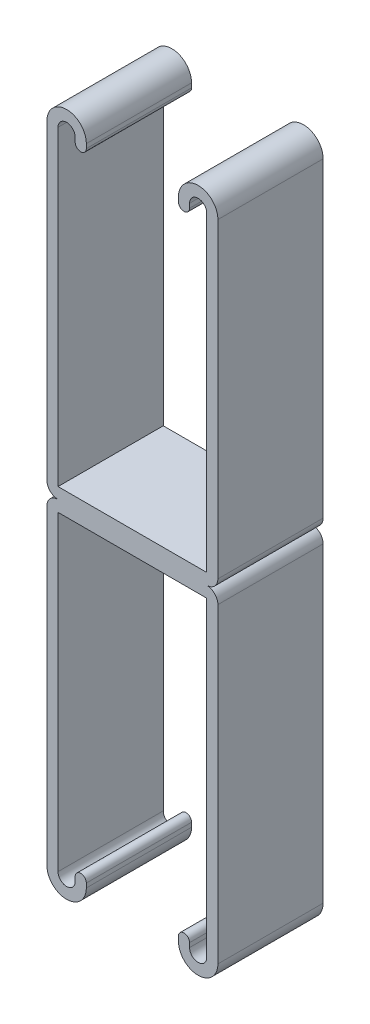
ISO-10303-21;
HEADER;
FILE_DESCRIPTION(('STEP AP214'),'2;1');
FILE_NAME('part.step','',(''),(''),'','','');
FILE_SCHEMA(('AUTOMOTIVE_DESIGN { 1 0 10303 214 1 1 1 1 }'));
ENDSEC;
DATA;
#1=APPLICATION_CONTEXT('core data for automotive mechanical design processes');
#2=APPLICATION_PROTOCOL_DEFINITION('international standard','automotive_design',2000,#1);
#3=PRODUCT_CONTEXT('',#1,'mechanical');
#4=PRODUCT('Part','Part','',(#3));
#5=PRODUCT_RELATED_PRODUCT_CATEGORY('part','',(#4));
#6=PRODUCT_DEFINITION_FORMATION('','',#4);
#7=PRODUCT_DEFINITION_CONTEXT('part definition',#1,'design');
#8=PRODUCT_DEFINITION('design','',#6,#7);
#9=PRODUCT_DEFINITION_SHAPE('','',#8);
#10=(LENGTH_UNIT() NAMED_UNIT(*) SI_UNIT(.MILLI.,.METRE.));
#11=(NAMED_UNIT(*) PLANE_ANGLE_UNIT() SI_UNIT($,.RADIAN.));
#12=(NAMED_UNIT(*) SI_UNIT($,.STERADIAN.) SOLID_ANGLE_UNIT());
#13=UNCERTAINTY_MEASURE_WITH_UNIT(LENGTH_MEASURE(1.E-05),#10,'distance_accuracy_value','');
#14=(GEOMETRIC_REPRESENTATION_CONTEXT(3) GLOBAL_UNCERTAINTY_ASSIGNED_CONTEXT((#13)) GLOBAL_UNIT_ASSIGNED_CONTEXT((#10,
#11,#12)) REPRESENTATION_CONTEXT('',''));
#15=CARTESIAN_POINT('',(0.,0.,0.));
#16=DIRECTION('',(0.,0.,1.));
#17=DIRECTION('',(1.,0.,0.));
#18=AXIS2_PLACEMENT_3D('',#15,#16,#17);
#19=CARTESIAN_POINT('',(-15.875,77.7875,12.7));
#20=DIRECTION('',(0.,0.,-1.));
#21=DIRECTION('',(-1.,0.,0.));
#22=AXIS2_PLACEMENT_3D('',#19,#20,#21);
#23=CYLINDRICAL_SURFACE('',#22,4.76250000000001);
#24=CARTESIAN_POINT('',(-15.875,77.7875,-12.7));
#25=DIRECTION('',(0.,0.,1.));
#26=DIRECTION('',(-1.,0.,0.));
#27=AXIS2_PLACEMENT_3D('',#24,#25,#26);
#28=CIRCLE('',#27,4.76250000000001);
#29=CARTESIAN_POINT('',(-11.1125,77.7875,-12.7));
#30=VERTEX_POINT('',#29);
#31=CARTESIAN_POINT('',(-20.6375,77.7875,-12.7));
#32=VERTEX_POINT('',#31);
#33=EDGE_CURVE('E190',#30,#32,#28,.T.);
#34=ORIENTED_EDGE('',*,*,#33,.T.);
#35=DIRECTION('',(0.,0.,-1.));
#36=VECTOR('',#35,1.);
#37=CARTESIAN_POINT('',(-20.6375,77.7875,12.7));
#38=LINE('',#37,#36);
#39=CARTESIAN_POINT('',(-20.6375,77.7875,12.7));
#40=VERTEX_POINT('',#39);
#41=EDGE_CURVE('E11',#40,#32,#38,.T.);
#42=ORIENTED_EDGE('',*,*,#41,.F.);
#43=CARTESIAN_POINT('',(-15.875,77.7875,12.7));
#44=DIRECTION('',(0.,0.,1.));
#45=DIRECTION('',(-1.,0.,0.));
#46=AXIS2_PLACEMENT_3D('',#43,#44,#45);
#47=CIRCLE('',#46,4.76250000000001);
#48=CARTESIAN_POINT('',(-11.1125,77.7875,12.7));
#49=VERTEX_POINT('',#48);
#50=EDGE_CURVE('E223',#49,#40,#47,.T.);
#51=ORIENTED_EDGE('',*,*,#50,.F.);
#52=DIRECTION('',(0.,0.,-1.));
#53=VECTOR('',#52,1.);
#54=CARTESIAN_POINT('',(-11.1125,77.7875,12.7));
#55=LINE('',#54,#53);
#56=EDGE_CURVE('E186',#49,#30,#55,.T.);
#57=ORIENTED_EDGE('',*,*,#56,.T.);
#58=EDGE_LOOP('',(#34,#42,#51,#57));
#59=FACE_BOUND('',#58,.T.);
#60=ADVANCED_FACE('F33',(#59),#23,.T.);
#61=CARTESIAN_POINT('',(-20.6375,77.7875,12.7));
#62=DIRECTION('',(1.,0.,0.));
#63=DIRECTION('',(0.,1.,0.));
#64=AXIS2_PLACEMENT_3D('',#61,#62,#63);
#65=PLANE('',#64);
#66=DIRECTION('',(0.,-1.,0.));
#67=VECTOR('',#66,1.);
#68=CARTESIAN_POINT('',(-20.6375,77.7875,-12.7));
#69=LINE('',#68,#67);
#70=CARTESIAN_POINT('',(-20.6375,2.6924,-12.7));
#71=VERTEX_POINT('',#70);
#72=EDGE_CURVE('E193',#32,#71,#69,.T.);
#73=ORIENTED_EDGE('',*,*,#72,.T.);
#74=DIRECTION('',(0.,0.,-1.));
#75=VECTOR('',#74,1.);
#76=CARTESIAN_POINT('',(-20.6375,2.6924,12.7));
#77=LINE('',#76,#75);
#78=CARTESIAN_POINT('',(-20.6375,2.6924,12.7));
#79=VERTEX_POINT('',#78);
#80=EDGE_CURVE('E41',#79,#71,#77,.T.);
#81=ORIENTED_EDGE('',*,*,#80,.F.);
#82=DIRECTION('',(0.,-1.,0.));
#83=VECTOR('',#82,1.);
#84=CARTESIAN_POINT('',(-20.6375,77.7875,12.7));
#85=LINE('',#84,#83);
#86=EDGE_CURVE('E120',#40,#79,#85,.T.);
#87=ORIENTED_EDGE('',*,*,#86,.F.);
#88=ORIENTED_EDGE('',*,*,#41,.T.);
#89=EDGE_LOOP('',(#73,#81,#87,#88));
#90=FACE_BOUND('',#89,.T.);
#91=ADVANCED_FACE('F385',(#90),#65,.F.);
#92=CARTESIAN_POINT('',(-17.9451,2.6924,12.7));
#93=DIRECTION('',(0.,0.,-1.));
#94=DIRECTION('',(-1.,0.,0.));
#95=AXIS2_PLACEMENT_3D('',#92,#93,#94);
#96=CYLINDRICAL_SURFACE('',#95,2.6924);
#97=CARTESIAN_POINT('',(-17.9451,2.6924,-12.7));
#98=DIRECTION('',(0.,0.,1.));
#99=DIRECTION('',(-1.,0.,0.));
#100=AXIS2_PLACEMENT_3D('',#97,#98,#99);
#101=CIRCLE('',#100,2.6924);
#102=CARTESIAN_POINT('',(-17.9451,0.,-12.7));
#103=VERTEX_POINT('',#102);
#104=EDGE_CURVE('E196',#71,#103,#101,.T.);
#105=ORIENTED_EDGE('',*,*,#104,.T.);
#106=DIRECTION('',(0.,0.,-1.));
#107=VECTOR('',#106,1.);
#108=CARTESIAN_POINT('',(-17.9451,0.,12.7));
#109=LINE('',#108,#107);
#110=CARTESIAN_POINT('',(-17.9451,0.,12.7));
#111=VERTEX_POINT('',#110);
#112=EDGE_CURVE('E260',#111,#103,#109,.T.);
#113=ORIENTED_EDGE('',*,*,#112,.F.);
#114=CARTESIAN_POINT('',(-17.9451,2.6924,12.7));
#115=DIRECTION('',(0.,0.,1.));
#116=DIRECTION('',(-1.,0.,0.));
#117=AXIS2_PLACEMENT_3D('',#114,#115,#116);
#118=CIRCLE('',#117,2.6924);
#119=EDGE_CURVE('E268',#79,#111,#118,.T.);
#120=ORIENTED_EDGE('',*,*,#119,.F.);
#121=ORIENTED_EDGE('',*,*,#80,.T.);
#122=EDGE_LOOP('',(#105,#113,#120,#121));
#123=FACE_BOUND('',#122,.T.);
#124=ADVANCED_FACE('F266',(#123),#96,.T.);
#125=CARTESIAN_POINT('',(17.9451,2.69240000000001,12.7));
#126=DIRECTION('',(0.,0.,-1.));
#127=DIRECTION('',(-1.,0.,0.));
#128=AXIS2_PLACEMENT_3D('',#125,#126,#127);
#129=CYLINDRICAL_SURFACE('',#128,2.6924);
#130=CARTESIAN_POINT('',(17.9451,2.69240000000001,-12.7));
#131=DIRECTION('',(0.,0.,1.));
#132=DIRECTION('',(1.,0.,0.));
#133=AXIS2_PLACEMENT_3D('',#130,#131,#132);
#134=CIRCLE('',#133,2.6924);
#135=CARTESIAN_POINT('',(17.9451,0.,-12.7));
#136=VERTEX_POINT('',#135);
#137=CARTESIAN_POINT('',(20.6375,2.69240000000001,-12.7));
#138=VERTEX_POINT('',#137);
#139=EDGE_CURVE('E198',#136,#138,#134,.T.);
#140=ORIENTED_EDGE('',*,*,#139,.T.);
#141=DIRECTION('',(0.,0.,-1.));
#142=VECTOR('',#141,1.);
#143=CARTESIAN_POINT('',(20.6375,2.69240000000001,12.7));
#144=LINE('',#143,#142);
#145=CARTESIAN_POINT('',(20.6375,2.69240000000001,12.7));
#146=VERTEX_POINT('',#145);
#147=EDGE_CURVE('E254',#146,#138,#144,.T.);
#148=ORIENTED_EDGE('',*,*,#147,.F.);
#149=CARTESIAN_POINT('',(17.9451,2.69240000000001,12.7));
#150=DIRECTION('',(0.,0.,1.));
#151=DIRECTION('',(1.,0.,0.));
#152=AXIS2_PLACEMENT_3D('',#149,#150,#151);
#153=CIRCLE('',#152,2.6924);
#154=CARTESIAN_POINT('',(17.9451,0.,12.7));
#155=VERTEX_POINT('',#154);
#156=EDGE_CURVE('E342',#155,#146,#153,.T.);
#157=ORIENTED_EDGE('',*,*,#156,.F.);
#158=DIRECTION('',(0.,0.,-1.));
#159=VECTOR('',#158,1.);
#160=CARTESIAN_POINT('',(17.9451,0.,12.7));
#161=LINE('',#160,#159);
#162=EDGE_CURVE('E257',#155,#136,#161,.T.);
#163=ORIENTED_EDGE('',*,*,#162,.T.);
#164=EDGE_LOOP('',(#140,#148,#157,#163));
#165=FACE_BOUND('',#164,.T.);
#166=ADVANCED_FACE('F392',(#165),#129,.T.);
#167=CARTESIAN_POINT('',(20.6375,2.69240000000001,12.7));
#168=DIRECTION('',(-1.,0.,0.));
#169=DIRECTION('',(0.,-1.,0.));
#170=AXIS2_PLACEMENT_3D('',#167,#168,#169);
#171=PLANE('',#170);
#172=DIRECTION('',(0.,1.,0.));
#173=VECTOR('',#172,1.);
#174=CARTESIAN_POINT('',(20.6375,2.69240000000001,-12.7));
#175=LINE('',#174,#173);
#176=CARTESIAN_POINT('',(20.6375,77.7875,-12.7));
#177=VERTEX_POINT('',#176);
#178=EDGE_CURVE('E200',#138,#177,#175,.T.);
#179=ORIENTED_EDGE('',*,*,#178,.T.);
#180=DIRECTION('',(0.,0.,-1.));
#181=VECTOR('',#180,1.);
#182=CARTESIAN_POINT('',(20.6375,77.7875,12.7));
#183=LINE('',#182,#181);
#184=CARTESIAN_POINT('',(20.6375,77.7875,12.7));
#185=VERTEX_POINT('',#184);
#186=EDGE_CURVE('E251',#185,#177,#183,.T.);
#187=ORIENTED_EDGE('',*,*,#186,.F.);
#188=DIRECTION('',(0.,1.,0.));
#189=VECTOR('',#188,1.);
#190=CARTESIAN_POINT('',(20.6375,2.69240000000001,12.7));
#191=LINE('',#190,#189);
#192=EDGE_CURVE('E344',#146,#185,#191,.T.);
#193=ORIENTED_EDGE('',*,*,#192,.F.);
#194=ORIENTED_EDGE('',*,*,#147,.T.);
#195=EDGE_LOOP('',(#179,#187,#193,#194));
#196=FACE_BOUND('',#195,.T.);
#197=ADVANCED_FACE('F397',(#196),#171,.F.);
#198=CARTESIAN_POINT('',(15.875,77.7875,12.7));
#199=DIRECTION('',(0.,0.,-1.));
#200=DIRECTION('',(-1.,0.,0.));
#201=AXIS2_PLACEMENT_3D('',#198,#199,#200);
#202=CYLINDRICAL_SURFACE('',#201,4.76250000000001);
#203=CARTESIAN_POINT('',(15.875,77.7875,-12.7));
#204=DIRECTION('',(0.,0.,1.));
#205=DIRECTION('',(1.,0.,0.));
#206=AXIS2_PLACEMENT_3D('',#203,#204,#205);
#207=CIRCLE('',#206,4.76250000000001);
#208=CARTESIAN_POINT('',(11.1125,77.7875,-12.7));
#209=VERTEX_POINT('',#208);
#210=EDGE_CURVE('E202',#177,#209,#207,.T.);
#211=ORIENTED_EDGE('',*,*,#210,.T.);
#212=DIRECTION('',(0.,0.,-1.));
#213=VECTOR('',#212,1.);
#214=CARTESIAN_POINT('',(11.1125,77.7875,12.7));
#215=LINE('',#214,#213);
#216=CARTESIAN_POINT('',(11.1125,77.7875,12.7));
#217=VERTEX_POINT('',#216);
#218=EDGE_CURVE('E248',#217,#209,#215,.T.);
#219=ORIENTED_EDGE('',*,*,#218,.F.);
#220=CARTESIAN_POINT('',(15.875,77.7875,12.7));
#221=DIRECTION('',(0.,0.,1.));
#222=DIRECTION('',(1.,0.,0.));
#223=AXIS2_PLACEMENT_3D('',#220,#221,#222);
#224=CIRCLE('',#223,4.76250000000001);
#225=EDGE_CURVE('E346',#185,#217,#224,.T.);
#226=ORIENTED_EDGE('',*,*,#225,.F.);
#227=ORIENTED_EDGE('',*,*,#186,.T.);
#228=EDGE_LOOP('',(#211,#219,#226,#227));
#229=FACE_BOUND('',#228,.T.);
#230=ADVANCED_FACE('F401',(#229),#202,.T.);
#231=CARTESIAN_POINT('',(11.1125,77.7875,12.7));
#232=DIRECTION('',(1.,0.,0.));
#233=DIRECTION('',(0.,1.,0.));
#234=AXIS2_PLACEMENT_3D('',#231,#232,#233);
#235=PLANE('',#234);
#236=DIRECTION('',(0.,-1.,0.));
#237=VECTOR('',#236,1.);
#238=CARTESIAN_POINT('',(11.1125,77.7875,-12.7));
#239=LINE('',#238,#237);
#240=CARTESIAN_POINT('',(11.1125,76.75245,-12.7));
#241=VERTEX_POINT('',#240);
#242=EDGE_CURVE('E204',#209,#241,#239,.T.);
#243=ORIENTED_EDGE('',*,*,#242,.T.);
#244=DIRECTION('',(0.,0.,-1.));
#245=VECTOR('',#244,1.);
#246=CARTESIAN_POINT('',(11.1125,76.75245,12.7));
#247=LINE('',#246,#245);
#248=CARTESIAN_POINT('',(11.1125,76.75245,12.7));
#249=VERTEX_POINT('',#248);
#250=EDGE_CURVE('E245',#249,#241,#247,.T.);
#251=ORIENTED_EDGE('',*,*,#250,.F.);
#252=DIRECTION('',(0.,-1.,0.));
#253=VECTOR('',#252,1.);
#254=CARTESIAN_POINT('',(11.1125,77.7875,12.7));
#255=LINE('',#254,#253);
#256=EDGE_CURVE('E348',#217,#249,#255,.T.);
#257=ORIENTED_EDGE('',*,*,#256,.F.);
#258=ORIENTED_EDGE('',*,*,#218,.T.);
#259=EDGE_LOOP('',(#243,#251,#257,#258));
#260=FACE_BOUND('',#259,.T.);
#261=ADVANCED_FACE('F405',(#260),#235,.F.);
#262=CARTESIAN_POINT('',(12.4587,76.75245,12.7));
#263=DIRECTION('',(0.,0.,-1.));
#264=DIRECTION('',(-1.,0.,0.));
#265=AXIS2_PLACEMENT_3D('',#262,#263,#264);
#266=CYLINDRICAL_SURFACE('',#265,1.3462);
#267=CARTESIAN_POINT('',(12.4587,76.75245,-12.7));
#268=DIRECTION('',(0.,0.,1.));
#269=DIRECTION('',(1.,0.,0.));
#270=AXIS2_PLACEMENT_3D('',#267,#268,#269);
#271=CIRCLE('',#270,1.3462);
#272=CARTESIAN_POINT('',(13.8049,76.75245,-12.7));
#273=VERTEX_POINT('',#272);
#274=EDGE_CURVE('E206',#241,#273,#271,.T.);
#275=ORIENTED_EDGE('',*,*,#274,.T.);
#276=DIRECTION('',(0.,0.,-1.));
#277=VECTOR('',#276,1.);
#278=CARTESIAN_POINT('',(13.8049,76.75245,12.7));
#279=LINE('',#278,#277);
#280=CARTESIAN_POINT('',(13.8049,76.75245,12.7));
#281=VERTEX_POINT('',#280);
#282=EDGE_CURVE('E242',#281,#273,#279,.T.);
#283=ORIENTED_EDGE('',*,*,#282,.F.);
#284=CARTESIAN_POINT('',(12.4587,76.75245,12.7));
#285=DIRECTION('',(0.,0.,1.));
#286=DIRECTION('',(1.,0.,0.));
#287=AXIS2_PLACEMENT_3D('',#284,#285,#286);
#288=CIRCLE('',#287,1.3462);
#289=EDGE_CURVE('E350',#249,#281,#288,.T.);
#290=ORIENTED_EDGE('',*,*,#289,.F.);
#291=ORIENTED_EDGE('',*,*,#250,.T.);
#292=EDGE_LOOP('',(#275,#283,#290,#291));
#293=FACE_BOUND('',#292,.T.);
#294=ADVANCED_FACE('F409',(#293),#266,.T.);
#295=CARTESIAN_POINT('',(13.8049,77.7875,12.7));
#296=DIRECTION('',(-1.,0.,0.));
#297=DIRECTION('',(0.,-1.,0.));
#298=AXIS2_PLACEMENT_3D('',#295,#296,#297);
#299=PLANE('',#298);
#300=DIRECTION('',(0.,1.,0.));
#301=VECTOR('',#300,1.);
#302=CARTESIAN_POINT('',(13.8049,77.7875,-12.7));
#303=LINE('',#302,#301);
#304=CARTESIAN_POINT('',(13.8049,77.7875,-12.7));
#305=VERTEX_POINT('',#304);
#306=EDGE_CURVE('E208',#273,#305,#303,.T.);
#307=ORIENTED_EDGE('',*,*,#306,.T.);
#308=DIRECTION('',(0.,0.,-1.));
#309=VECTOR('',#308,1.);
#310=CARTESIAN_POINT('',(13.8049,77.7875,12.7));
#311=LINE('',#310,#309);
#312=CARTESIAN_POINT('',(13.8049,77.7875,12.7));
#313=VERTEX_POINT('',#312);
#314=EDGE_CURVE('E239',#313,#305,#311,.T.);
#315=ORIENTED_EDGE('',*,*,#314,.F.);
#316=DIRECTION('',(0.,1.,0.));
#317=VECTOR('',#316,1.);
#318=CARTESIAN_POINT('',(13.8049,77.7875,12.7));
#319=LINE('',#318,#317);
#320=EDGE_CURVE('E352',#281,#313,#319,.T.);
#321=ORIENTED_EDGE('',*,*,#320,.F.);
#322=ORIENTED_EDGE('',*,*,#282,.T.);
#323=EDGE_LOOP('',(#307,#315,#321,#322));
#324=FACE_BOUND('',#323,.T.);
#325=ADVANCED_FACE('F413',(#324),#299,.F.);
#326=CARTESIAN_POINT('',(15.875,77.7875,12.7));
#327=DIRECTION('',(0.,0.,-1.));
#328=DIRECTION('',(-1.,0.,0.));
#329=AXIS2_PLACEMENT_3D('',#326,#327,#328);
#330=CYLINDRICAL_SURFACE('',#329,2.07010000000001);
#331=CARTESIAN_POINT('',(15.875,77.7875,-12.7));
#332=DIRECTION('',(0.,0.,-1.));
#333=DIRECTION('',(1.,0.,0.));
#334=AXIS2_PLACEMENT_3D('',#331,#332,#333);
#335=CIRCLE('',#334,2.07010000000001);
#336=CARTESIAN_POINT('',(17.9451,77.7875,-12.7));
#337=VERTEX_POINT('',#336);
#338=EDGE_CURVE('E210',#305,#337,#335,.T.);
#339=ORIENTED_EDGE('',*,*,#338,.T.);
#340=DIRECTION('',(0.,0.,-1.));
#341=VECTOR('',#340,1.);
#342=CARTESIAN_POINT('',(17.9451,77.7875,12.7));
#343=LINE('',#342,#341);
#344=CARTESIAN_POINT('',(17.9451,77.7875,12.7));
#345=VERTEX_POINT('',#344);
#346=EDGE_CURVE('E236',#345,#337,#343,.T.);
#347=ORIENTED_EDGE('',*,*,#346,.F.);
#348=CARTESIAN_POINT('',(15.875,77.7875,12.7));
#349=DIRECTION('',(0.,0.,-1.));
#350=DIRECTION('',(1.,0.,0.));
#351=AXIS2_PLACEMENT_3D('',#348,#349,#350);
#352=CIRCLE('',#351,2.07010000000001);
#353=EDGE_CURVE('E354',#313,#345,#352,.T.);
#354=ORIENTED_EDGE('',*,*,#353,.F.);
#355=ORIENTED_EDGE('',*,*,#314,.T.);
#356=EDGE_LOOP('',(#339,#347,#354,#355));
#357=FACE_BOUND('',#356,.T.);
#358=ADVANCED_FACE('F417',(#357),#330,.F.);
#359=CARTESIAN_POINT('',(17.9451,2.6924,12.7));
#360=DIRECTION('',(1.,0.,0.));
#361=DIRECTION('',(0.,1.,0.));
#362=AXIS2_PLACEMENT_3D('',#359,#360,#361);
#363=PLANE('',#362);
#364=DIRECTION('',(0.,-1.,0.));
#365=VECTOR('',#364,1.);
#366=CARTESIAN_POINT('',(17.9451,2.6924,-12.7));
#367=LINE('',#366,#365);
#368=CARTESIAN_POINT('',(17.9451,2.6924,-12.7));
#369=VERTEX_POINT('',#368);
#370=EDGE_CURVE('E212',#337,#369,#367,.T.);
#371=ORIENTED_EDGE('',*,*,#370,.T.);
#372=DIRECTION('',(0.,0.,-1.));
#373=VECTOR('',#372,1.);
#374=CARTESIAN_POINT('',(17.9451,2.6924,12.7));
#375=LINE('',#374,#373);
#376=CARTESIAN_POINT('',(17.9451,2.6924,12.7));
#377=VERTEX_POINT('',#376);
#378=EDGE_CURVE('E233',#377,#369,#375,.T.);
#379=ORIENTED_EDGE('',*,*,#378,.F.);
#380=DIRECTION('',(0.,-1.,0.));
#381=VECTOR('',#380,1.);
#382=CARTESIAN_POINT('',(17.9451,2.6924,12.7));
#383=LINE('',#382,#381);
#384=EDGE_CURVE('E356',#345,#377,#383,.T.);
#385=ORIENTED_EDGE('',*,*,#384,.F.);
#386=ORIENTED_EDGE('',*,*,#346,.T.);
#387=EDGE_LOOP('',(#371,#379,#385,#386));
#388=FACE_BOUND('',#387,.T.);
#389=ADVANCED_FACE('F421',(#388),#363,.F.);
#390=CARTESIAN_POINT('',(-17.9451,2.6924,12.7));
#391=DIRECTION('',(0.,-1.,0.));
#392=DIRECTION('',(0.,0.,-1.));
#393=AXIS2_PLACEMENT_3D('',#390,#391,#392);
#394=PLANE('',#393);
#395=DIRECTION('',(-1.,0.,0.));
#396=VECTOR('',#395,1.);
#397=CARTESIAN_POINT('',(-17.9451,2.6924,-12.7));
#398=LINE('',#397,#396);
#399=CARTESIAN_POINT('',(-17.9451,2.6924,-12.7));
#400=VERTEX_POINT('',#399);
#401=EDGE_CURVE('E214',#369,#400,#398,.T.);
#402=ORIENTED_EDGE('',*,*,#401,.T.);
#403=DIRECTION('',(0.,0.,-1.));
#404=VECTOR('',#403,1.);
#405=CARTESIAN_POINT('',(-17.9451,2.6924,12.7));
#406=LINE('',#405,#404);
#407=CARTESIAN_POINT('',(-17.9451,2.6924,12.7));
#408=VERTEX_POINT('',#407);
#409=EDGE_CURVE('E230',#408,#400,#406,.T.);
#410=ORIENTED_EDGE('',*,*,#409,.F.);
#411=DIRECTION('',(-1.,0.,0.));
#412=VECTOR('',#411,1.);
#413=CARTESIAN_POINT('',(-17.9451,2.6924,12.7));
#414=LINE('',#413,#412);
#415=EDGE_CURVE('E358',#377,#408,#414,.T.);
#416=ORIENTED_EDGE('',*,*,#415,.F.);
#417=ORIENTED_EDGE('',*,*,#378,.T.);
#418=EDGE_LOOP('',(#402,#410,#416,#417));
#419=FACE_BOUND('',#418,.T.);
#420=ADVANCED_FACE('F425',(#419),#394,.F.);
#421=CARTESIAN_POINT('',(-17.9451,77.7875,12.7));
#422=DIRECTION('',(-1.,0.,0.));
#423=DIRECTION('',(0.,-1.,0.));
#424=AXIS2_PLACEMENT_3D('',#421,#422,#423);
#425=PLANE('',#424);
#426=DIRECTION('',(0.,1.,0.));
#427=VECTOR('',#426,1.);
#428=CARTESIAN_POINT('',(-17.9451,77.7875,-12.7));
#429=LINE('',#428,#427);
#430=CARTESIAN_POINT('',(-17.9451,77.7875,-12.7));
#431=VERTEX_POINT('',#430);
#432=EDGE_CURVE('E216',#400,#431,#429,.T.);
#433=ORIENTED_EDGE('',*,*,#432,.T.);
#434=DIRECTION('',(0.,0.,-1.));
#435=VECTOR('',#434,1.);
#436=CARTESIAN_POINT('',(-17.9451,77.7875,12.7));
#437=LINE('',#436,#435);
#438=CARTESIAN_POINT('',(-17.9451,77.7875,12.7));
#439=VERTEX_POINT('',#438);
#440=EDGE_CURVE('E227',#439,#431,#437,.T.);
#441=ORIENTED_EDGE('',*,*,#440,.F.);
#442=DIRECTION('',(0.,1.,0.));
#443=VECTOR('',#442,1.);
#444=CARTESIAN_POINT('',(-17.9451,77.7875,12.7));
#445=LINE('',#444,#443);
#446=EDGE_CURVE('E360',#408,#439,#445,.T.);
#447=ORIENTED_EDGE('',*,*,#446,.F.);
#448=ORIENTED_EDGE('',*,*,#409,.T.);
#449=EDGE_LOOP('',(#433,#441,#447,#448));
#450=FACE_BOUND('',#449,.T.);
#451=ADVANCED_FACE('F366',(#450),#425,.F.);
#452=CARTESIAN_POINT('',(-15.875,77.7875,12.7));
#453=DIRECTION('',(0.,0.,-1.));
#454=DIRECTION('',(-1.,0.,0.));
#455=AXIS2_PLACEMENT_3D('',#452,#453,#454);
#456=CYLINDRICAL_SURFACE('',#455,2.07010000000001);
#457=CARTESIAN_POINT('',(-15.875,77.7875,-12.7));
#458=DIRECTION('',(0.,0.,-1.));
#459=DIRECTION('',(-1.,0.,0.));
#460=AXIS2_PLACEMENT_3D('',#457,#458,#459);
#461=CIRCLE('',#460,2.07010000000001);
#462=CARTESIAN_POINT('',(-13.8049,77.7875,-12.7));
#463=VERTEX_POINT('',#462);
#464=EDGE_CURVE('E218',#431,#463,#461,.T.);
#465=ORIENTED_EDGE('',*,*,#464,.T.);
#466=DIRECTION('',(0.,0.,-1.));
#467=VECTOR('',#466,1.);
#468=CARTESIAN_POINT('',(-13.8049,77.7875,12.7));
#469=LINE('',#468,#467);
#470=CARTESIAN_POINT('',(-13.8049,77.7875,12.7));
#471=VERTEX_POINT('',#470);
#472=EDGE_CURVE('E181',#471,#463,#469,.T.);
#473=ORIENTED_EDGE('',*,*,#472,.F.);
#474=CARTESIAN_POINT('',(-15.875,77.7875,12.7));
#475=DIRECTION('',(0.,0.,-1.));
#476=DIRECTION('',(-1.,0.,0.));
#477=AXIS2_PLACEMENT_3D('',#474,#475,#476);
#478=CIRCLE('',#477,2.07010000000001);
#479=EDGE_CURVE('E172',#439,#471,#478,.T.);
#480=ORIENTED_EDGE('',*,*,#479,.F.);
#481=ORIENTED_EDGE('',*,*,#440,.T.);
#482=EDGE_LOOP('',(#465,#473,#480,#481));
#483=FACE_BOUND('',#482,.T.);
#484=ADVANCED_FACE('F370',(#483),#456,.F.);
#485=CARTESIAN_POINT('',(-13.8049,77.7875,12.7));
#486=DIRECTION('',(1.,0.,0.));
#487=DIRECTION('',(0.,1.,0.));
#488=AXIS2_PLACEMENT_3D('',#485,#486,#487);
#489=PLANE('',#488);
#490=DIRECTION('',(0.,-1.,0.));
#491=VECTOR('',#490,1.);
#492=CARTESIAN_POINT('',(-13.8049,77.7875,-12.7));
#493=LINE('',#492,#491);
#494=CARTESIAN_POINT('',(-13.8049,76.75245,-12.7));
#495=VERTEX_POINT('',#494);
#496=EDGE_CURVE('E180',#463,#495,#493,.T.);
#497=ORIENTED_EDGE('',*,*,#496,.T.);
#498=DIRECTION('',(0.,0.,-1.));
#499=VECTOR('',#498,1.);
#500=CARTESIAN_POINT('',(-13.8049,76.75245,12.7));
#501=LINE('',#500,#499);
#502=CARTESIAN_POINT('',(-13.8049,76.75245,12.7));
#503=VERTEX_POINT('',#502);
#504=EDGE_CURVE('E177',#503,#495,#501,.T.);
#505=ORIENTED_EDGE('',*,*,#504,.F.);
#506=DIRECTION('',(0.,-1.,0.));
#507=VECTOR('',#506,1.);
#508=CARTESIAN_POINT('',(-13.8049,77.7875,12.7));
#509=LINE('',#508,#507);
#510=EDGE_CURVE('E166',#471,#503,#509,.T.);
#511=ORIENTED_EDGE('',*,*,#510,.F.);
#512=ORIENTED_EDGE('',*,*,#472,.T.);
#513=EDGE_LOOP('',(#497,#505,#511,#512));
#514=FACE_BOUND('',#513,.T.);
#515=ADVANCED_FACE('F178',(#514),#489,.F.);
#516=CARTESIAN_POINT('',(-12.4587,76.75245,12.7));
#517=DIRECTION('',(0.,0.,-1.));
#518=DIRECTION('',(-1.,0.,0.));
#519=AXIS2_PLACEMENT_3D('',#516,#517,#518);
#520=CYLINDRICAL_SURFACE('',#519,1.3462);
#521=CARTESIAN_POINT('',(-12.4587,76.75245,-12.7));
#522=DIRECTION('',(0.,0.,1.));
#523=DIRECTION('',(-1.,0.,0.));
#524=AXIS2_PLACEMENT_3D('',#521,#522,#523);
#525=CIRCLE('',#524,1.3462);
#526=CARTESIAN_POINT('',(-11.1125,76.75245,-12.7));
#527=VERTEX_POINT('',#526);
#528=EDGE_CURVE('E106',#495,#527,#525,.T.);
#529=ORIENTED_EDGE('',*,*,#528,.T.);
#530=DIRECTION('',(0.,0.,-1.));
#531=VECTOR('',#530,1.);
#532=CARTESIAN_POINT('',(-11.1125,76.75245,12.7));
#533=LINE('',#532,#531);
#534=CARTESIAN_POINT('',(-11.1125,76.75245,12.7));
#535=VERTEX_POINT('',#534);
#536=EDGE_CURVE('E182',#535,#527,#533,.T.);
#537=ORIENTED_EDGE('',*,*,#536,.F.);
#538=CARTESIAN_POINT('',(-12.4587,76.75245,12.7));
#539=DIRECTION('',(0.,0.,1.));
#540=DIRECTION('',(-1.,0.,0.));
#541=AXIS2_PLACEMENT_3D('',#538,#539,#540);
#542=CIRCLE('',#541,1.3462);
#543=EDGE_CURVE('E170',#503,#535,#542,.T.);
#544=ORIENTED_EDGE('',*,*,#543,.F.);
#545=ORIENTED_EDGE('',*,*,#504,.T.);
#546=EDGE_LOOP('',(#529,#537,#544,#545));
#547=FACE_BOUND('',#546,.T.);
#548=ADVANCED_FACE('F184',(#547),#520,.T.);
#549=CARTESIAN_POINT('',(-11.1125,77.7875,12.7));
#550=DIRECTION('',(-1.,0.,0.));
#551=DIRECTION('',(0.,-1.,0.));
#552=AXIS2_PLACEMENT_3D('',#549,#550,#551);
#553=PLANE('',#552);
#554=DIRECTION('',(0.,1.,0.));
#555=VECTOR('',#554,1.);
#556=CARTESIAN_POINT('',(-11.1125,77.7875,-12.7));
#557=LINE('',#556,#555);
#558=EDGE_CURVE('E112',#527,#30,#557,.T.);
#559=ORIENTED_EDGE('',*,*,#558,.T.);
#560=ORIENTED_EDGE('',*,*,#56,.F.);
#561=DIRECTION('',(0.,1.,0.));
#562=VECTOR('',#561,1.);
#563=CARTESIAN_POINT('',(-11.1125,77.7875,12.7));
#564=LINE('',#563,#562);
#565=EDGE_CURVE('E49',#535,#49,#564,.T.);
#566=ORIENTED_EDGE('',*,*,#565,.F.);
#567=ORIENTED_EDGE('',*,*,#536,.T.);
#568=EDGE_LOOP('',(#559,#560,#566,#567));
#569=FACE_BOUND('',#568,.T.);
#570=ADVANCED_FACE('F374',(#569),#553,.F.);
#571=CARTESIAN_POINT('',(-15.875,77.7875,12.7));
#572=DIRECTION('',(0.,0.,-1.));
#573=DIRECTION('',(-1.,0.,0.));
#574=AXIS2_PLACEMENT_3D('',#571,#572,#573);
#575=PLANE('',#574);
#576=ORIENTED_EDGE('',*,*,#50,.T.);
#577=ORIENTED_EDGE('',*,*,#86,.T.);
#578=ORIENTED_EDGE('',*,*,#119,.T.);
#579=CARTESIAN_POINT('',(-17.9451,-2.6924,12.7));
#580=DIRECTION('',(0.,0.,-1.));
#581=DIRECTION('',(-1.,0.,0.));
#582=AXIS2_PLACEMENT_3D('',#579,#580,#581);
#583=CIRCLE('',#582,2.6924);
#584=CARTESIAN_POINT('',(-20.6375,-2.6924,12.7));
#585=VERTEX_POINT('',#584);
#586=EDGE_CURVE('E783',#585,#111,#583,.T.);
#587=ORIENTED_EDGE('',*,*,#586,.F.);
#588=DIRECTION('',(0.,1.,0.));
#589=VECTOR('',#588,1.);
#590=CARTESIAN_POINT('',(-20.6375,-77.7875,12.7));
#591=LINE('',#590,#589);
#592=CARTESIAN_POINT('',(-20.6375,-77.7875,12.7));
#593=VERTEX_POINT('',#592);
#594=EDGE_CURVE('E295',#593,#585,#591,.T.);
#595=ORIENTED_EDGE('',*,*,#594,.F.);
#596=CARTESIAN_POINT('',(-15.875,-77.7875,12.7));
#597=DIRECTION('',(0.,0.,-1.));
#598=DIRECTION('',(-1.,0.,0.));
#599=AXIS2_PLACEMENT_3D('',#596,#597,#598);
#600=CIRCLE('',#599,4.76250000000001);
#601=CARTESIAN_POINT('',(-11.1125,-77.7875,12.7));
#602=VERTEX_POINT('',#601);
#603=EDGE_CURVE('E284',#602,#593,#600,.T.);
#604=ORIENTED_EDGE('',*,*,#603,.F.);
#605=DIRECTION('',(0.,-1.,0.));
#606=VECTOR('',#605,1.);
#607=CARTESIAN_POINT('',(-11.1125,-77.7875,12.7));
#608=LINE('',#607,#606);
#609=CARTESIAN_POINT('',(-11.1125,-76.75245,12.7));
#610=VERTEX_POINT('',#609);
#611=EDGE_CURVE('E732',#610,#602,#608,.T.);
#612=ORIENTED_EDGE('',*,*,#611,.F.);
#613=CARTESIAN_POINT('',(-12.4587,-76.75245,12.7));
#614=DIRECTION('',(0.,0.,-1.));
#615=DIRECTION('',(-1.,0.,0.));
#616=AXIS2_PLACEMENT_3D('',#613,#614,#615);
#617=CIRCLE('',#616,1.3462);
#618=CARTESIAN_POINT('',(-13.8049,-76.75245,12.7));
#619=VERTEX_POINT('',#618);
#620=EDGE_CURVE('E741',#619,#610,#617,.T.);
#621=ORIENTED_EDGE('',*,*,#620,.F.);
#622=DIRECTION('',(0.,1.,0.));
#623=VECTOR('',#622,1.);
#624=CARTESIAN_POINT('',(-13.8049,-77.7875,12.7));
#625=LINE('',#624,#623);
#626=CARTESIAN_POINT('',(-13.8049,-77.7875,12.7));
#627=VERTEX_POINT('',#626);
#628=EDGE_CURVE('E745',#627,#619,#625,.T.);
#629=ORIENTED_EDGE('',*,*,#628,.F.);
#630=CARTESIAN_POINT('',(-15.875,-77.7875,12.7));
#631=DIRECTION('',(0.,0.,1.));
#632=DIRECTION('',(-1.,0.,0.));
#633=AXIS2_PLACEMENT_3D('',#630,#631,#632);
#634=CIRCLE('',#633,2.07010000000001);
#635=CARTESIAN_POINT('',(-17.9451,-77.7875,12.7));
#636=VERTEX_POINT('',#635);
#637=EDGE_CURVE('E747',#636,#627,#634,.T.);
#638=ORIENTED_EDGE('',*,*,#637,.F.);
#639=DIRECTION('',(0.,-1.,0.));
#640=VECTOR('',#639,1.);
#641=CARTESIAN_POINT('',(-17.9451,-77.7875,12.7));
#642=LINE('',#641,#640);
#643=CARTESIAN_POINT('',(-17.9451,-2.6924,12.7));
#644=VERTEX_POINT('',#643);
#645=EDGE_CURVE('E753',#644,#636,#642,.T.);
#646=ORIENTED_EDGE('',*,*,#645,.F.);
#647=DIRECTION('',(-1.,0.,0.));
#648=VECTOR('',#647,1.);
#649=CARTESIAN_POINT('',(-17.9451,-2.6924,12.7));
#650=LINE('',#649,#648);
#651=CARTESIAN_POINT('',(17.9451,-2.6924,12.7));
#652=VERTEX_POINT('',#651);
#653=EDGE_CURVE('E756',#652,#644,#650,.T.);
#654=ORIENTED_EDGE('',*,*,#653,.F.);
#655=DIRECTION('',(0.,1.,0.));
#656=VECTOR('',#655,1.);
#657=CARTESIAN_POINT('',(17.9451,-2.6924,12.7));
#658=LINE('',#657,#656);
#659=CARTESIAN_POINT('',(17.9451,-77.7875,12.7));
#660=VERTEX_POINT('',#659);
#661=EDGE_CURVE('E759',#660,#652,#658,.T.);
#662=ORIENTED_EDGE('',*,*,#661,.F.);
#663=CARTESIAN_POINT('',(15.875,-77.7875,12.7));
#664=DIRECTION('',(0.,0.,1.));
#665=DIRECTION('',(1.,0.,0.));
#666=AXIS2_PLACEMENT_3D('',#663,#664,#665);
#667=CIRCLE('',#666,2.07010000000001);
#668=CARTESIAN_POINT('',(13.8049,-77.7875,12.7));
#669=VERTEX_POINT('',#668);
#670=EDGE_CURVE('E762',#669,#660,#667,.T.);
#671=ORIENTED_EDGE('',*,*,#670,.F.);
#672=DIRECTION('',(0.,-1.,0.));
#673=VECTOR('',#672,1.);
#674=CARTESIAN_POINT('',(13.8049,-77.7875,12.7));
#675=LINE('',#674,#673);
#676=CARTESIAN_POINT('',(13.8049,-76.75245,12.7));
#677=VERTEX_POINT('',#676);
#678=EDGE_CURVE('E765',#677,#669,#675,.T.);
#679=ORIENTED_EDGE('',*,*,#678,.F.);
#680=CARTESIAN_POINT('',(12.4587,-76.75245,12.7));
#681=DIRECTION('',(0.,0.,-1.));
#682=DIRECTION('',(1.,0.,0.));
#683=AXIS2_PLACEMENT_3D('',#680,#681,#682);
#684=CIRCLE('',#683,1.3462);
#685=CARTESIAN_POINT('',(11.1125,-76.75245,12.7));
#686=VERTEX_POINT('',#685);
#687=EDGE_CURVE('E768',#686,#677,#684,.T.);
#688=ORIENTED_EDGE('',*,*,#687,.F.);
#689=DIRECTION('',(0.,1.,0.));
#690=VECTOR('',#689,1.);
#691=CARTESIAN_POINT('',(11.1125,-77.7875,12.7));
#692=LINE('',#691,#690);
#693=CARTESIAN_POINT('',(11.1125,-77.7875,12.7));
#694=VERTEX_POINT('',#693);
#695=EDGE_CURVE('E771',#694,#686,#692,.T.);
#696=ORIENTED_EDGE('',*,*,#695,.F.);
#697=CARTESIAN_POINT('',(15.875,-77.7875,12.7));
#698=DIRECTION('',(0.,0.,-1.));
#699=DIRECTION('',(1.,0.,0.));
#700=AXIS2_PLACEMENT_3D('',#697,#698,#699);
#701=CIRCLE('',#700,4.76250000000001);
#702=CARTESIAN_POINT('',(20.6375,-77.7875,12.7));
#703=VERTEX_POINT('',#702);
#704=EDGE_CURVE('E774',#703,#694,#701,.T.);
#705=ORIENTED_EDGE('',*,*,#704,.F.);
#706=DIRECTION('',(0.,-1.,0.));
#707=VECTOR('',#706,1.);
#708=CARTESIAN_POINT('',(20.6375,-2.69240000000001,12.7));
#709=LINE('',#708,#707);
#710=CARTESIAN_POINT('',(20.6375,-2.69240000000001,12.7));
#711=VERTEX_POINT('',#710);
#712=EDGE_CURVE('E777',#711,#703,#709,.T.);
#713=ORIENTED_EDGE('',*,*,#712,.F.);
#714=CARTESIAN_POINT('',(17.9451,-2.69240000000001,12.7));
#715=DIRECTION('',(0.,0.,-1.));
#716=DIRECTION('',(1.,0.,0.));
#717=AXIS2_PLACEMENT_3D('',#714,#715,#716);
#718=CIRCLE('',#717,2.6924);
#719=EDGE_CURVE('E780',#155,#711,#718,.T.);
#720=ORIENTED_EDGE('',*,*,#719,.F.);
#721=ORIENTED_EDGE('',*,*,#156,.T.);
#722=ORIENTED_EDGE('',*,*,#192,.T.);
#723=ORIENTED_EDGE('',*,*,#225,.T.);
#724=ORIENTED_EDGE('',*,*,#256,.T.);
#725=ORIENTED_EDGE('',*,*,#289,.T.);
#726=ORIENTED_EDGE('',*,*,#320,.T.);
#727=ORIENTED_EDGE('',*,*,#353,.T.);
#728=ORIENTED_EDGE('',*,*,#384,.T.);
#729=ORIENTED_EDGE('',*,*,#415,.T.);
#730=ORIENTED_EDGE('',*,*,#446,.T.);
#731=ORIENTED_EDGE('',*,*,#479,.T.);
#732=ORIENTED_EDGE('',*,*,#510,.T.);
#733=ORIENTED_EDGE('',*,*,#543,.T.);
#734=ORIENTED_EDGE('',*,*,#565,.T.);
#735=EDGE_LOOP('',(#576,#577,#578,#587,#595,#604,#612,#621,#629,#638,#646,#654,#662,#671,#679,
#688,#696,#705,#713,#720,#721,#722,#723,#724,#725,#726,#727,#728,#729,#730,#731,#732,#733,#734));
#736=FACE_BOUND('',#735,.T.);
#737=ADVANCED_FACE('F168',(#736),#575,.F.);
#738=CARTESIAN_POINT('',(-15.875,77.7875,-12.7));
#739=DIRECTION('',(0.,0.,-1.));
#740=DIRECTION('',(-1.,0.,0.));
#741=AXIS2_PLACEMENT_3D('',#738,#739,#740);
#742=PLANE('',#741);
#743=ORIENTED_EDGE('',*,*,#33,.F.);
#744=ORIENTED_EDGE('',*,*,#558,.F.);
#745=ORIENTED_EDGE('',*,*,#528,.F.);
#746=ORIENTED_EDGE('',*,*,#496,.F.);
#747=ORIENTED_EDGE('',*,*,#464,.F.);
#748=ORIENTED_EDGE('',*,*,#432,.F.);
#749=ORIENTED_EDGE('',*,*,#401,.F.);
#750=ORIENTED_EDGE('',*,*,#370,.F.);
#751=ORIENTED_EDGE('',*,*,#338,.F.);
#752=ORIENTED_EDGE('',*,*,#306,.F.);
#753=ORIENTED_EDGE('',*,*,#274,.F.);
#754=ORIENTED_EDGE('',*,*,#242,.F.);
#755=ORIENTED_EDGE('',*,*,#210,.F.);
#756=ORIENTED_EDGE('',*,*,#178,.F.);
#757=ORIENTED_EDGE('',*,*,#139,.F.);
#758=CARTESIAN_POINT('',(17.9451,-2.69240000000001,-12.7));
#759=DIRECTION('',(0.,0.,-1.));
#760=DIRECTION('',(1.,0.,0.));
#761=AXIS2_PLACEMENT_3D('',#758,#759,#760);
#762=CIRCLE('',#761,2.6924);
#763=CARTESIAN_POINT('',(20.6375,-2.69240000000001,-12.7));
#764=VERTEX_POINT('',#763);
#765=EDGE_CURVE('E282',#136,#764,#762,.T.);
#766=ORIENTED_EDGE('',*,*,#765,.T.);
#767=DIRECTION('',(0.,-1.,0.));
#768=VECTOR('',#767,1.);
#769=CARTESIAN_POINT('',(20.6375,-2.69240000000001,-12.7));
#770=LINE('',#769,#768);
#771=CARTESIAN_POINT('',(20.6375,-77.7875,-12.7));
#772=VERTEX_POINT('',#771);
#773=EDGE_CURVE('E287',#764,#772,#770,.T.);
#774=ORIENTED_EDGE('',*,*,#773,.T.);
#775=CARTESIAN_POINT('',(15.875,-77.7875,-12.7));
#776=DIRECTION('',(0.,0.,-1.));
#777=DIRECTION('',(1.,0.,0.));
#778=AXIS2_PLACEMENT_3D('',#775,#776,#777);
#779=CIRCLE('',#778,4.76250000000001);
#780=CARTESIAN_POINT('',(11.1125,-77.7875,-12.7));
#781=VERTEX_POINT('',#780);
#782=EDGE_CURVE('E819',#772,#781,#779,.T.);
#783=ORIENTED_EDGE('',*,*,#782,.T.);
#784=DIRECTION('',(0.,1.,0.));
#785=VECTOR('',#784,1.);
#786=CARTESIAN_POINT('',(11.1125,-77.7875,-12.7));
#787=LINE('',#786,#785);
#788=CARTESIAN_POINT('',(11.1125,-76.75245,-12.7));
#789=VERTEX_POINT('',#788);
#790=EDGE_CURVE('E816',#781,#789,#787,.T.);
#791=ORIENTED_EDGE('',*,*,#790,.T.);
#792=CARTESIAN_POINT('',(12.4587,-76.75245,-12.7));
#793=DIRECTION('',(0.,0.,-1.));
#794=DIRECTION('',(1.,0.,0.));
#795=AXIS2_PLACEMENT_3D('',#792,#793,#794);
#796=CIRCLE('',#795,1.3462);
#797=CARTESIAN_POINT('',(13.8049,-76.75245,-12.7));
#798=VERTEX_POINT('',#797);
#799=EDGE_CURVE('E813',#789,#798,#796,.T.);
#800=ORIENTED_EDGE('',*,*,#799,.T.);
#801=DIRECTION('',(0.,-1.,0.));
#802=VECTOR('',#801,1.);
#803=CARTESIAN_POINT('',(13.8049,-77.7875,-12.7));
#804=LINE('',#803,#802);
#805=CARTESIAN_POINT('',(13.8049,-77.7875,-12.7));
#806=VERTEX_POINT('',#805);
#807=EDGE_CURVE('E810',#798,#806,#804,.T.);
#808=ORIENTED_EDGE('',*,*,#807,.T.);
#809=CARTESIAN_POINT('',(15.875,-77.7875,-12.7));
#810=DIRECTION('',(0.,0.,1.));
#811=DIRECTION('',(1.,0.,0.));
#812=AXIS2_PLACEMENT_3D('',#809,#810,#811);
#813=CIRCLE('',#812,2.07010000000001);
#814=CARTESIAN_POINT('',(17.9451,-77.7875,-12.7));
#815=VERTEX_POINT('',#814);
#816=EDGE_CURVE('E807',#806,#815,#813,.T.);
#817=ORIENTED_EDGE('',*,*,#816,.T.);
#818=DIRECTION('',(0.,1.,0.));
#819=VECTOR('',#818,1.);
#820=CARTESIAN_POINT('',(17.9451,-2.6924,-12.7));
#821=LINE('',#820,#819);
#822=CARTESIAN_POINT('',(17.9451,-2.6924,-12.7));
#823=VERTEX_POINT('',#822);
#824=EDGE_CURVE('E804',#815,#823,#821,.T.);
#825=ORIENTED_EDGE('',*,*,#824,.T.);
#826=DIRECTION('',(-1.,0.,0.));
#827=VECTOR('',#826,1.);
#828=CARTESIAN_POINT('',(-17.9451,-2.6924,-12.7));
#829=LINE('',#828,#827);
#830=CARTESIAN_POINT('',(-17.9451,-2.6924,-12.7));
#831=VERTEX_POINT('',#830);
#832=EDGE_CURVE('E801',#823,#831,#829,.T.);
#833=ORIENTED_EDGE('',*,*,#832,.T.);
#834=DIRECTION('',(0.,-1.,0.));
#835=VECTOR('',#834,1.);
#836=CARTESIAN_POINT('',(-17.9451,-77.7875,-12.7));
#837=LINE('',#836,#835);
#838=CARTESIAN_POINT('',(-17.9451,-77.7875,-12.7));
#839=VERTEX_POINT('',#838);
#840=EDGE_CURVE('E798',#831,#839,#837,.T.);
#841=ORIENTED_EDGE('',*,*,#840,.T.);
#842=CARTESIAN_POINT('',(-15.875,-77.7875,-12.7));
#843=DIRECTION('',(0.,0.,1.));
#844=DIRECTION('',(-1.,0.,0.));
#845=AXIS2_PLACEMENT_3D('',#842,#843,#844);
#846=CIRCLE('',#845,2.07010000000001);
#847=CARTESIAN_POINT('',(-13.8049,-77.7875,-12.7));
#848=VERTEX_POINT('',#847);
#849=EDGE_CURVE('E795',#839,#848,#846,.T.);
#850=ORIENTED_EDGE('',*,*,#849,.T.);
#851=DIRECTION('',(0.,1.,0.));
#852=VECTOR('',#851,1.);
#853=CARTESIAN_POINT('',(-13.8049,-77.7875,-12.7));
#854=LINE('',#853,#852);
#855=CARTESIAN_POINT('',(-13.8049,-76.75245,-12.7));
#856=VERTEX_POINT('',#855);
#857=EDGE_CURVE('E792',#848,#856,#854,.T.);
#858=ORIENTED_EDGE('',*,*,#857,.T.);
#859=CARTESIAN_POINT('',(-12.4587,-76.75245,-12.7));
#860=DIRECTION('',(0.,0.,-1.));
#861=DIRECTION('',(-1.,0.,0.));
#862=AXIS2_PLACEMENT_3D('',#859,#860,#861);
#863=CIRCLE('',#862,1.3462);
#864=CARTESIAN_POINT('',(-11.1125,-76.75245,-12.7));
#865=VERTEX_POINT('',#864);
#866=EDGE_CURVE('E790',#856,#865,#863,.T.);
#867=ORIENTED_EDGE('',*,*,#866,.T.);
#868=DIRECTION('',(0.,-1.,0.));
#869=VECTOR('',#868,1.);
#870=CARTESIAN_POINT('',(-11.1125,-77.7875,-12.7));
#871=LINE('',#870,#869);
#872=CARTESIAN_POINT('',(-11.1125,-77.7875,-12.7));
#873=VERTEX_POINT('',#872);
#874=EDGE_CURVE('E734',#865,#873,#871,.T.);
#875=ORIENTED_EDGE('',*,*,#874,.T.);
#876=CARTESIAN_POINT('',(-15.875,-77.7875,-12.7));
#877=DIRECTION('',(0.,0.,-1.));
#878=DIRECTION('',(-1.,0.,0.));
#879=AXIS2_PLACEMENT_3D('',#876,#877,#878);
#880=CIRCLE('',#879,4.76250000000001);
#881=CARTESIAN_POINT('',(-20.6375,-77.7875,-12.7));
#882=VERTEX_POINT('',#881);
#883=EDGE_CURVE('E787',#873,#882,#880,.T.);
#884=ORIENTED_EDGE('',*,*,#883,.T.);
#885=DIRECTION('',(0.,1.,0.));
#886=VECTOR('',#885,1.);
#887=CARTESIAN_POINT('',(-20.6375,-77.7875,-12.7));
#888=LINE('',#887,#886);
#889=CARTESIAN_POINT('',(-20.6375,-2.6924,-12.7));
#890=VERTEX_POINT('',#889);
#891=EDGE_CURVE('E279',#882,#890,#888,.T.);
#892=ORIENTED_EDGE('',*,*,#891,.T.);
#893=CARTESIAN_POINT('',(-17.9451,-2.6924,-12.7));
#894=DIRECTION('',(0.,0.,-1.));
#895=DIRECTION('',(-1.,0.,0.));
#896=AXIS2_PLACEMENT_3D('',#893,#894,#895);
#897=CIRCLE('',#896,2.6924);
#898=EDGE_CURVE('E275',#890,#103,#897,.T.);
#899=ORIENTED_EDGE('',*,*,#898,.T.);
#900=ORIENTED_EDGE('',*,*,#104,.F.);
#901=ORIENTED_EDGE('',*,*,#72,.F.);
#902=EDGE_LOOP('',(#743,#744,#745,#746,#747,#748,#749,#750,#751,#752,#753,#754,#755,#756,#757,
#766,#774,#783,#791,#800,#808,#817,#825,#833,#841,#850,#858,#867,#875,#884,#892,#899,#900,#901));
#903=FACE_BOUND('',#902,.T.);
#904=ADVANCED_FACE('F272',(#903),#742,.T.);
#905=CARTESIAN_POINT('',(-15.875,-77.7875,12.7));
#906=DIRECTION('',(0.,0.,-1.));
#907=DIRECTION('',(-1.,0.,0.));
#908=AXIS2_PLACEMENT_3D('',#905,#906,#907);
#909=CYLINDRICAL_SURFACE('',#908,4.76250000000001);
#910=ORIENTED_EDGE('',*,*,#883,.F.);
#911=DIRECTION('',(0.,0.,-1.));
#912=VECTOR('',#911,1.);
#913=CARTESIAN_POINT('',(-11.1125,-77.7875,12.7));
#914=LINE('',#913,#912);
#915=EDGE_CURVE('E194',#602,#873,#914,.T.);
#916=ORIENTED_EDGE('',*,*,#915,.F.);
#917=ORIENTED_EDGE('',*,*,#603,.T.);
#918=DIRECTION('',(0.,0.,-1.));
#919=VECTOR('',#918,1.);
#920=CARTESIAN_POINT('',(-20.6375,-77.7875,12.7));
#921=LINE('',#920,#919);
#922=EDGE_CURVE('E291',#593,#882,#921,.T.);
#923=ORIENTED_EDGE('',*,*,#922,.T.);
#924=EDGE_LOOP('',(#910,#916,#917,#923));
#925=FACE_BOUND('',#924,.T.);
#926=ADVANCED_FACE('F478',(#925),#909,.T.);
#927=CARTESIAN_POINT('',(-11.1125,-77.7875,12.7));
#928=DIRECTION('',(1.,0.,0.));
#929=DIRECTION('',(0.,1.,0.));
#930=AXIS2_PLACEMENT_3D('',#927,#928,#929);
#931=PLANE('',#930);
#932=ORIENTED_EDGE('',*,*,#874,.F.);
#933=DIRECTION('',(0.,0.,-1.));
#934=VECTOR('',#933,1.);
#935=CARTESIAN_POINT('',(-11.1125,-76.75245,12.7));
#936=LINE('',#935,#934);
#937=EDGE_CURVE('E334',#610,#865,#936,.T.);
#938=ORIENTED_EDGE('',*,*,#937,.F.);
#939=ORIENTED_EDGE('',*,*,#611,.T.);
#940=ORIENTED_EDGE('',*,*,#915,.T.);
#941=EDGE_LOOP('',(#932,#938,#939,#940));
#942=FACE_BOUND('',#941,.T.);
#943=ADVANCED_FACE('F486',(#942),#931,.T.);
#944=CARTESIAN_POINT('',(-12.4587,-76.75245,12.7));
#945=DIRECTION('',(0.,0.,-1.));
#946=DIRECTION('',(-1.,0.,0.));
#947=AXIS2_PLACEMENT_3D('',#944,#945,#946);
#948=CYLINDRICAL_SURFACE('',#947,1.3462);
#949=ORIENTED_EDGE('',*,*,#866,.F.);
#950=DIRECTION('',(0.,0.,-1.));
#951=VECTOR('',#950,1.);
#952=CARTESIAN_POINT('',(-13.8049,-76.75245,12.7));
#953=LINE('',#952,#951);
#954=EDGE_CURVE('E331',#619,#856,#953,.T.);
#955=ORIENTED_EDGE('',*,*,#954,.F.);
#956=ORIENTED_EDGE('',*,*,#620,.T.);
#957=ORIENTED_EDGE('',*,*,#937,.T.);
#958=EDGE_LOOP('',(#949,#955,#956,#957));
#959=FACE_BOUND('',#958,.T.);
#960=ADVANCED_FACE('F496',(#959),#948,.T.);
#961=CARTESIAN_POINT('',(-13.8049,-77.7875,12.7));
#962=DIRECTION('',(-1.,0.,0.));
#963=DIRECTION('',(0.,-1.,0.));
#964=AXIS2_PLACEMENT_3D('',#961,#962,#963);
#965=PLANE('',#964);
#966=ORIENTED_EDGE('',*,*,#857,.F.);
#967=DIRECTION('',(0.,0.,-1.));
#968=VECTOR('',#967,1.);
#969=CARTESIAN_POINT('',(-13.8049,-77.7875,12.7));
#970=LINE('',#969,#968);
#971=EDGE_CURVE('E328',#627,#848,#970,.T.);
#972=ORIENTED_EDGE('',*,*,#971,.F.);
#973=ORIENTED_EDGE('',*,*,#628,.T.);
#974=ORIENTED_EDGE('',*,*,#954,.T.);
#975=EDGE_LOOP('',(#966,#972,#973,#974));
#976=FACE_BOUND('',#975,.T.);
#977=ADVANCED_FACE('F506',(#976),#965,.T.);
#978=CARTESIAN_POINT('',(-15.875,-77.7875,12.7));
#979=DIRECTION('',(0.,0.,-1.));
#980=DIRECTION('',(-1.,0.,0.));
#981=AXIS2_PLACEMENT_3D('',#978,#979,#980);
#982=CYLINDRICAL_SURFACE('',#981,2.07010000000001);
#983=ORIENTED_EDGE('',*,*,#849,.F.);
#984=DIRECTION('',(0.,0.,-1.));
#985=VECTOR('',#984,1.);
#986=CARTESIAN_POINT('',(-17.9451,-77.7875,12.7));
#987=LINE('',#986,#985);
#988=EDGE_CURVE('E325',#636,#839,#987,.T.);
#989=ORIENTED_EDGE('',*,*,#988,.F.);
#990=ORIENTED_EDGE('',*,*,#637,.T.);
#991=ORIENTED_EDGE('',*,*,#971,.T.);
#992=EDGE_LOOP('',(#983,#989,#990,#991));
#993=FACE_BOUND('',#992,.T.);
#994=ADVANCED_FACE('F516',(#993),#982,.F.);
#995=CARTESIAN_POINT('',(-17.9451,-77.7875,12.7));
#996=DIRECTION('',(1.,0.,0.));
#997=DIRECTION('',(0.,1.,0.));
#998=AXIS2_PLACEMENT_3D('',#995,#996,#997);
#999=PLANE('',#998);
#1000=ORIENTED_EDGE('',*,*,#840,.F.);
#1001=DIRECTION('',(0.,0.,-1.));
#1002=VECTOR('',#1001,1.);
#1003=CARTESIAN_POINT('',(-17.9451,-2.6924,12.7));
#1004=LINE('',#1003,#1002);
#1005=EDGE_CURVE('E322',#644,#831,#1004,.T.);
#1006=ORIENTED_EDGE('',*,*,#1005,.F.);
#1007=ORIENTED_EDGE('',*,*,#645,.T.);
#1008=ORIENTED_EDGE('',*,*,#988,.T.);
#1009=EDGE_LOOP('',(#1000,#1006,#1007,#1008));
#1010=FACE_BOUND('',#1009,.T.);
#1011=ADVANCED_FACE('F526',(#1010),#999,.T.);
#1012=CARTESIAN_POINT('',(-17.9451,-2.6924,12.7));
#1013=DIRECTION('',(0.,-1.,0.));
#1014=DIRECTION('',(0.,0.,-1.));
#1015=AXIS2_PLACEMENT_3D('',#1012,#1013,#1014);
#1016=PLANE('',#1015);
#1017=ORIENTED_EDGE('',*,*,#832,.F.);
#1018=DIRECTION('',(0.,0.,-1.));
#1019=VECTOR('',#1018,1.);
#1020=CARTESIAN_POINT('',(17.9451,-2.6924,12.7));
#1021=LINE('',#1020,#1019);
#1022=EDGE_CURVE('E319',#652,#823,#1021,.T.);
#1023=ORIENTED_EDGE('',*,*,#1022,.F.);
#1024=ORIENTED_EDGE('',*,*,#653,.T.);
#1025=ORIENTED_EDGE('',*,*,#1005,.T.);
#1026=EDGE_LOOP('',(#1017,#1023,#1024,#1025));
#1027=FACE_BOUND('',#1026,.T.);
#1028=ADVANCED_FACE('F536',(#1027),#1016,.T.);
#1029=CARTESIAN_POINT('',(17.9451,-2.6924,12.7));
#1030=DIRECTION('',(-1.,0.,0.));
#1031=DIRECTION('',(0.,-1.,0.));
#1032=AXIS2_PLACEMENT_3D('',#1029,#1030,#1031);
#1033=PLANE('',#1032);
#1034=ORIENTED_EDGE('',*,*,#824,.F.);
#1035=DIRECTION('',(0.,0.,-1.));
#1036=VECTOR('',#1035,1.);
#1037=CARTESIAN_POINT('',(17.9451,-77.7875,12.7));
#1038=LINE('',#1037,#1036);
#1039=EDGE_CURVE('E316',#660,#815,#1038,.T.);
#1040=ORIENTED_EDGE('',*,*,#1039,.F.);
#1041=ORIENTED_EDGE('',*,*,#661,.T.);
#1042=ORIENTED_EDGE('',*,*,#1022,.T.);
#1043=EDGE_LOOP('',(#1034,#1040,#1041,#1042));
#1044=FACE_BOUND('',#1043,.T.);
#1045=ADVANCED_FACE('F546',(#1044),#1033,.T.);
#1046=CARTESIAN_POINT('',(15.875,-77.7875,12.7));
#1047=DIRECTION('',(0.,0.,-1.));
#1048=DIRECTION('',(-1.,0.,0.));
#1049=AXIS2_PLACEMENT_3D('',#1046,#1047,#1048);
#1050=CYLINDRICAL_SURFACE('',#1049,2.07010000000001);
#1051=ORIENTED_EDGE('',*,*,#816,.F.);
#1052=DIRECTION('',(0.,0.,-1.));
#1053=VECTOR('',#1052,1.);
#1054=CARTESIAN_POINT('',(13.8049,-77.7875,12.7));
#1055=LINE('',#1054,#1053);
#1056=EDGE_CURVE('E313',#669,#806,#1055,.T.);
#1057=ORIENTED_EDGE('',*,*,#1056,.F.);
#1058=ORIENTED_EDGE('',*,*,#670,.T.);
#1059=ORIENTED_EDGE('',*,*,#1039,.T.);
#1060=EDGE_LOOP('',(#1051,#1057,#1058,#1059));
#1061=FACE_BOUND('',#1060,.T.);
#1062=ADVANCED_FACE('F556',(#1061),#1050,.F.);
#1063=CARTESIAN_POINT('',(13.8049,-77.7875,12.7));
#1064=DIRECTION('',(1.,0.,0.));
#1065=DIRECTION('',(0.,1.,0.));
#1066=AXIS2_PLACEMENT_3D('',#1063,#1064,#1065);
#1067=PLANE('',#1066);
#1068=ORIENTED_EDGE('',*,*,#807,.F.);
#1069=DIRECTION('',(0.,0.,-1.));
#1070=VECTOR('',#1069,1.);
#1071=CARTESIAN_POINT('',(13.8049,-76.75245,12.7));
#1072=LINE('',#1071,#1070);
#1073=EDGE_CURVE('E310',#677,#798,#1072,.T.);
#1074=ORIENTED_EDGE('',*,*,#1073,.F.);
#1075=ORIENTED_EDGE('',*,*,#678,.T.);
#1076=ORIENTED_EDGE('',*,*,#1056,.T.);
#1077=EDGE_LOOP('',(#1068,#1074,#1075,#1076));
#1078=FACE_BOUND('',#1077,.T.);
#1079=ADVANCED_FACE('F566',(#1078),#1067,.T.);
#1080=CARTESIAN_POINT('',(12.4587,-76.75245,12.7));
#1081=DIRECTION('',(0.,0.,-1.));
#1082=DIRECTION('',(-1.,0.,0.));
#1083=AXIS2_PLACEMENT_3D('',#1080,#1081,#1082);
#1084=CYLINDRICAL_SURFACE('',#1083,1.3462);
#1085=ORIENTED_EDGE('',*,*,#799,.F.);
#1086=DIRECTION('',(0.,0.,-1.));
#1087=VECTOR('',#1086,1.);
#1088=CARTESIAN_POINT('',(11.1125,-76.75245,12.7));
#1089=LINE('',#1088,#1087);
#1090=EDGE_CURVE('E307',#686,#789,#1089,.T.);
#1091=ORIENTED_EDGE('',*,*,#1090,.F.);
#1092=ORIENTED_EDGE('',*,*,#687,.T.);
#1093=ORIENTED_EDGE('',*,*,#1073,.T.);
#1094=EDGE_LOOP('',(#1085,#1091,#1092,#1093));
#1095=FACE_BOUND('',#1094,.T.);
#1096=ADVANCED_FACE('F576',(#1095),#1084,.T.);
#1097=CARTESIAN_POINT('',(11.1125,-77.7875,12.7));
#1098=DIRECTION('',(-1.,0.,0.));
#1099=DIRECTION('',(0.,-1.,0.));
#1100=AXIS2_PLACEMENT_3D('',#1097,#1098,#1099);
#1101=PLANE('',#1100);
#1102=ORIENTED_EDGE('',*,*,#790,.F.);
#1103=DIRECTION('',(0.,0.,-1.));
#1104=VECTOR('',#1103,1.);
#1105=CARTESIAN_POINT('',(11.1125,-77.7875,12.7));
#1106=LINE('',#1105,#1104);
#1107=EDGE_CURVE('E304',#694,#781,#1106,.T.);
#1108=ORIENTED_EDGE('',*,*,#1107,.F.);
#1109=ORIENTED_EDGE('',*,*,#695,.T.);
#1110=ORIENTED_EDGE('',*,*,#1090,.T.);
#1111=EDGE_LOOP('',(#1102,#1108,#1109,#1110));
#1112=FACE_BOUND('',#1111,.T.);
#1113=ADVANCED_FACE('F586',(#1112),#1101,.T.);
#1114=CARTESIAN_POINT('',(15.875,-77.7875,12.7));
#1115=DIRECTION('',(0.,0.,-1.));
#1116=DIRECTION('',(-1.,0.,0.));
#1117=AXIS2_PLACEMENT_3D('',#1114,#1115,#1116);
#1118=CYLINDRICAL_SURFACE('',#1117,4.76250000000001);
#1119=ORIENTED_EDGE('',*,*,#782,.F.);
#1120=DIRECTION('',(0.,0.,-1.));
#1121=VECTOR('',#1120,1.);
#1122=CARTESIAN_POINT('',(20.6375,-77.7875,12.7));
#1123=LINE('',#1122,#1121);
#1124=EDGE_CURVE('E301',#703,#772,#1123,.T.);
#1125=ORIENTED_EDGE('',*,*,#1124,.F.);
#1126=ORIENTED_EDGE('',*,*,#704,.T.);
#1127=ORIENTED_EDGE('',*,*,#1107,.T.);
#1128=EDGE_LOOP('',(#1119,#1125,#1126,#1127));
#1129=FACE_BOUND('',#1128,.T.);
#1130=ADVANCED_FACE('F596',(#1129),#1118,.T.);
#1131=CARTESIAN_POINT('',(20.6375,-2.69240000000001,12.7));
#1132=DIRECTION('',(1.,0.,0.));
#1133=DIRECTION('',(0.,1.,0.));
#1134=AXIS2_PLACEMENT_3D('',#1131,#1132,#1133);
#1135=PLANE('',#1134);
#1136=ORIENTED_EDGE('',*,*,#773,.F.);
#1137=DIRECTION('',(0.,0.,-1.));
#1138=VECTOR('',#1137,1.);
#1139=CARTESIAN_POINT('',(20.6375,-2.69240000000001,12.7));
#1140=LINE('',#1139,#1138);
#1141=EDGE_CURVE('E298',#711,#764,#1140,.T.);
#1142=ORIENTED_EDGE('',*,*,#1141,.F.);
#1143=ORIENTED_EDGE('',*,*,#712,.T.);
#1144=ORIENTED_EDGE('',*,*,#1124,.T.);
#1145=EDGE_LOOP('',(#1136,#1142,#1143,#1144));
#1146=FACE_BOUND('',#1145,.T.);
#1147=ADVANCED_FACE('F606',(#1146),#1135,.T.);
#1148=CARTESIAN_POINT('',(17.9451,-2.69240000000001,12.7));
#1149=DIRECTION('',(0.,0.,-1.));
#1150=DIRECTION('',(-1.,0.,0.));
#1151=AXIS2_PLACEMENT_3D('',#1148,#1149,#1150);
#1152=CYLINDRICAL_SURFACE('',#1151,2.6924);
#1153=ORIENTED_EDGE('',*,*,#765,.F.);
#1154=ORIENTED_EDGE('',*,*,#162,.F.);
#1155=ORIENTED_EDGE('',*,*,#719,.T.);
#1156=ORIENTED_EDGE('',*,*,#1141,.T.);
#1157=EDGE_LOOP('',(#1153,#1154,#1155,#1156));
#1158=FACE_BOUND('',#1157,.T.);
#1159=ADVANCED_FACE('F616',(#1158),#1152,.T.);
#1160=CARTESIAN_POINT('',(-17.9451,-2.6924,12.7));
#1161=DIRECTION('',(0.,0.,-1.));
#1162=DIRECTION('',(-1.,0.,0.));
#1163=AXIS2_PLACEMENT_3D('',#1160,#1161,#1162);
#1164=CYLINDRICAL_SURFACE('',#1163,2.6924);
#1165=ORIENTED_EDGE('',*,*,#898,.F.);
#1166=DIRECTION('',(0.,0.,-1.));
#1167=VECTOR('',#1166,1.);
#1168=CARTESIAN_POINT('',(-20.6375,-2.6924,12.7));
#1169=LINE('',#1168,#1167);
#1170=EDGE_CURVE('E294',#585,#890,#1169,.T.);
#1171=ORIENTED_EDGE('',*,*,#1170,.F.);
#1172=ORIENTED_EDGE('',*,*,#586,.T.);
#1173=ORIENTED_EDGE('',*,*,#112,.T.);
#1174=EDGE_LOOP('',(#1165,#1171,#1172,#1173));
#1175=FACE_BOUND('',#1174,.T.);
#1176=ADVANCED_FACE('F626',(#1175),#1164,.T.);
#1177=CARTESIAN_POINT('',(-20.6375,-77.7875,12.7));
#1178=DIRECTION('',(-1.,0.,0.));
#1179=DIRECTION('',(0.,-1.,0.));
#1180=AXIS2_PLACEMENT_3D('',#1177,#1178,#1179);
#1181=PLANE('',#1180);
#1182=ORIENTED_EDGE('',*,*,#891,.F.);
#1183=ORIENTED_EDGE('',*,*,#922,.F.);
#1184=ORIENTED_EDGE('',*,*,#594,.T.);
#1185=ORIENTED_EDGE('',*,*,#1170,.T.);
#1186=EDGE_LOOP('',(#1182,#1183,#1184,#1185));
#1187=FACE_BOUND('',#1186,.T.);
#1188=ADVANCED_FACE('F636',(#1187),#1181,.T.);
#1189=CLOSED_SHELL('',(#60,#91,#124,#166,#197,#230,#261,#294,#325,#358,#389,#420,#451,#484,#515,
#548,#570,#737,#904,#926,#943,#960,#977,#994,#1011,#1028,#1045,#1062,#1079,#1096,#1113,#1130,
#1147,#1159,#1176,#1188));
#1190=MANIFOLD_SOLID_BREP('B2',#1189);
#1191=ADVANCED_BREP_SHAPE_REPRESENTATION('',(#18,#1190),#14);
#1192=SHAPE_DEFINITION_REPRESENTATION(#9,#1191);
ENDSEC;
END-ISO-10303-21;
